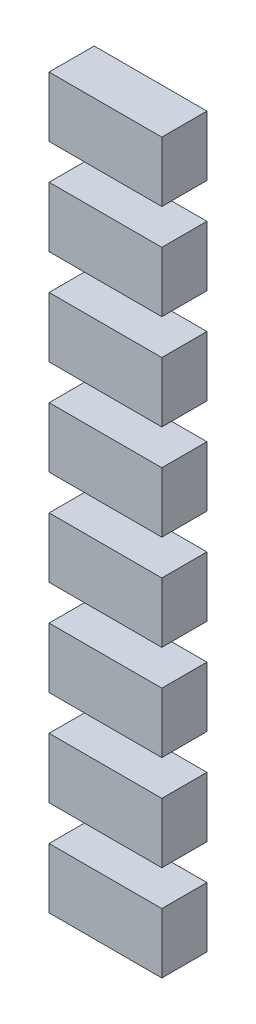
ISO-10303-21;
HEADER;
FILE_DESCRIPTION(('STEP AP214'),'2;1');
FILE_NAME('part.step','',(''),(''),'','','');
FILE_SCHEMA(('AUTOMOTIVE_DESIGN { 1 0 10303 214 1 1 1 1 }'));
ENDSEC;
DATA;
#1=APPLICATION_CONTEXT('core data for automotive mechanical design processes');
#2=APPLICATION_PROTOCOL_DEFINITION('international standard','automotive_design',2000,#1);
#3=PRODUCT_CONTEXT('',#1,'mechanical');
#4=PRODUCT('Part','Part','',(#3));
#5=PRODUCT_RELATED_PRODUCT_CATEGORY('part','',(#4));
#6=PRODUCT_DEFINITION_FORMATION('','',#4);
#7=PRODUCT_DEFINITION_CONTEXT('part definition',#1,'design');
#8=PRODUCT_DEFINITION('design','',#6,#7);
#9=PRODUCT_DEFINITION_SHAPE('','',#8);
#10=(LENGTH_UNIT() NAMED_UNIT(*) SI_UNIT(.MILLI.,.METRE.));
#11=(NAMED_UNIT(*) PLANE_ANGLE_UNIT() SI_UNIT($,.RADIAN.));
#12=(NAMED_UNIT(*) SI_UNIT($,.STERADIAN.) SOLID_ANGLE_UNIT());
#13=UNCERTAINTY_MEASURE_WITH_UNIT(LENGTH_MEASURE(1.E-05),#10,'distance_accuracy_value','');
#14=(GEOMETRIC_REPRESENTATION_CONTEXT(3) GLOBAL_UNCERTAINTY_ASSIGNED_CONTEXT((#13)) GLOBAL_UNIT_ASSIGNED_CONTEXT((#10,
#11,#12)) REPRESENTATION_CONTEXT('',''));
#15=CARTESIAN_POINT('',(0.,0.,0.));
#16=DIRECTION('',(0.,0.,1.));
#17=DIRECTION('',(1.,0.,0.));
#18=AXIS2_PLACEMENT_3D('',#15,#16,#17);
#19=CARTESIAN_POINT('',(28.,-13.864,0.));
#20=DIRECTION('',(1.,0.,0.));
#21=DIRECTION('',(0.,0.,-1.));
#22=AXIS2_PLACEMENT_3D('',#19,#20,#21);
#23=PLANE('',#22);
#24=DIRECTION('',(0.,-1.,0.));
#25=VECTOR('',#24,1.);
#26=CARTESIAN_POINT('',(28.,-13.864,-1.2));
#27=LINE('',#26,#25);
#28=CARTESIAN_POINT('',(28.,-13.864,-1.2));
#29=VERTEX_POINT('',#28);
#30=CARTESIAN_POINT('',(28.,-15.464,-1.2));
#31=VERTEX_POINT('',#30);
#32=EDGE_CURVE('E12',#29,#31,#27,.T.);
#33=ORIENTED_EDGE('',*,*,#32,.T.);
#34=DIRECTION('',(0.,0.,-1.));
#35=VECTOR('',#34,1.);
#36=CARTESIAN_POINT('',(28.,-15.464,0.));
#37=LINE('',#36,#35);
#38=CARTESIAN_POINT('',(28.,-15.464,0.));
#39=VERTEX_POINT('',#38);
#40=EDGE_CURVE('E127',#39,#31,#37,.T.);
#41=ORIENTED_EDGE('',*,*,#40,.F.);
#42=DIRECTION('',(0.,-1.,0.));
#43=VECTOR('',#42,1.);
#44=CARTESIAN_POINT('',(28.,-13.864,0.));
#45=LINE('',#44,#43);
#46=CARTESIAN_POINT('',(28.,-13.864,0.));
#47=VERTEX_POINT('',#46);
#48=EDGE_CURVE('E60',#47,#39,#45,.T.);
#49=ORIENTED_EDGE('',*,*,#48,.F.);
#50=DIRECTION('',(0.,0.,-1.));
#51=VECTOR('',#50,1.);
#52=CARTESIAN_POINT('',(28.,-13.864,0.));
#53=LINE('',#52,#51);
#54=EDGE_CURVE('E115',#47,#29,#53,.T.);
#55=ORIENTED_EDGE('',*,*,#54,.T.);
#56=EDGE_LOOP('',(#33,#41,#49,#55));
#57=FACE_BOUND('',#56,.T.);
#58=ADVANCED_FACE('F56',(#57),#23,.F.);
#59=CARTESIAN_POINT('',(28.,-15.464,0.));
#60=DIRECTION('',(0.,1.,0.));
#61=DIRECTION('',(0.,0.,1.));
#62=AXIS2_PLACEMENT_3D('',#59,#60,#61);
#63=PLANE('',#62);
#64=DIRECTION('',(1.,0.,0.));
#65=VECTOR('',#64,1.);
#66=CARTESIAN_POINT('',(28.,-15.464,-1.2));
#67=LINE('',#66,#65);
#68=CARTESIAN_POINT('',(31.,-15.464,-1.2));
#69=VERTEX_POINT('',#68);
#70=EDGE_CURVE('E66',#31,#69,#67,.T.);
#71=ORIENTED_EDGE('',*,*,#70,.T.);
#72=DIRECTION('',(0.,0.,-1.));
#73=VECTOR('',#72,1.);
#74=CARTESIAN_POINT('',(31.,-15.464,0.));
#75=LINE('',#74,#73);
#76=CARTESIAN_POINT('',(31.,-15.464,0.));
#77=VERTEX_POINT('',#76);
#78=EDGE_CURVE('E111',#77,#69,#75,.T.);
#79=ORIENTED_EDGE('',*,*,#78,.F.);
#80=DIRECTION('',(1.,0.,0.));
#81=VECTOR('',#80,1.);
#82=CARTESIAN_POINT('',(28.,-15.464,0.));
#83=LINE('',#82,#81);
#84=EDGE_CURVE('E90',#39,#77,#83,.T.);
#85=ORIENTED_EDGE('',*,*,#84,.F.);
#86=ORIENTED_EDGE('',*,*,#40,.T.);
#87=EDGE_LOOP('',(#71,#79,#85,#86));
#88=FACE_BOUND('',#87,.T.);
#89=ADVANCED_FACE('F130',(#88),#63,.F.);
#90=CARTESIAN_POINT('',(31.,-15.464,0.));
#91=DIRECTION('',(-1.,0.,0.));
#92=DIRECTION('',(0.,0.,1.));
#93=AXIS2_PLACEMENT_3D('',#90,#91,#92);
#94=PLANE('',#93);
#95=DIRECTION('',(0.,1.,0.));
#96=VECTOR('',#95,1.);
#97=CARTESIAN_POINT('',(31.,-15.464,-1.2));
#98=LINE('',#97,#96);
#99=CARTESIAN_POINT('',(31.,-13.864,-1.2));
#100=VERTEX_POINT('',#99);
#101=EDGE_CURVE('E106',#69,#100,#98,.T.);
#102=ORIENTED_EDGE('',*,*,#101,.T.);
#103=DIRECTION('',(0.,0.,-1.));
#104=VECTOR('',#103,1.);
#105=CARTESIAN_POINT('',(31.,-13.864,0.));
#106=LINE('',#105,#104);
#107=CARTESIAN_POINT('',(31.,-13.864,0.));
#108=VERTEX_POINT('',#107);
#109=EDGE_CURVE('E109',#108,#100,#106,.T.);
#110=ORIENTED_EDGE('',*,*,#109,.F.);
#111=DIRECTION('',(0.,1.,0.));
#112=VECTOR('',#111,1.);
#113=CARTESIAN_POINT('',(31.,-15.464,0.));
#114=LINE('',#113,#112);
#115=EDGE_CURVE('E123',#77,#108,#114,.T.);
#116=ORIENTED_EDGE('',*,*,#115,.F.);
#117=ORIENTED_EDGE('',*,*,#78,.T.);
#118=EDGE_LOOP('',(#102,#110,#116,#117));
#119=FACE_BOUND('',#118,.T.);
#120=ADVANCED_FACE('F107',(#119),#94,.F.);
#121=CARTESIAN_POINT('',(31.,-13.864,0.));
#122=DIRECTION('',(0.,-1.,0.));
#123=DIRECTION('',(0.,0.,-1.));
#124=AXIS2_PLACEMENT_3D('',#121,#122,#123);
#125=PLANE('',#124);
#126=DIRECTION('',(-1.,0.,0.));
#127=VECTOR('',#126,1.);
#128=CARTESIAN_POINT('',(31.,-13.864,-1.2));
#129=LINE('',#128,#127);
#130=EDGE_CURVE('E100',#100,#29,#129,.T.);
#131=ORIENTED_EDGE('',*,*,#130,.T.);
#132=ORIENTED_EDGE('',*,*,#54,.F.);
#133=DIRECTION('',(-1.,0.,0.));
#134=VECTOR('',#133,1.);
#135=CARTESIAN_POINT('',(31.,-13.864,0.));
#136=LINE('',#135,#134);
#137=EDGE_CURVE('E114',#108,#47,#136,.T.);
#138=ORIENTED_EDGE('',*,*,#137,.F.);
#139=ORIENTED_EDGE('',*,*,#109,.T.);
#140=EDGE_LOOP('',(#131,#132,#138,#139));
#141=FACE_BOUND('',#140,.T.);
#142=ADVANCED_FACE('F113',(#141),#125,.F.);
#143=CARTESIAN_POINT('',(0.,0.,0.));
#144=DIRECTION('',(0.,0.,1.));
#145=DIRECTION('',(1.,0.,0.));
#146=AXIS2_PLACEMENT_3D('',#143,#144,#145);
#147=PLANE('',#146);
#148=ORIENTED_EDGE('',*,*,#48,.T.);
#149=ORIENTED_EDGE('',*,*,#84,.T.);
#150=ORIENTED_EDGE('',*,*,#115,.T.);
#151=ORIENTED_EDGE('',*,*,#137,.T.);
#152=EDGE_LOOP('',(#148,#149,#150,#151));
#153=FACE_BOUND('',#152,.T.);
#154=ADVANCED_FACE('F58',(#153),#147,.T.);
#155=CARTESIAN_POINT('',(0.,0.,-1.2));
#156=DIRECTION('',(0.,0.,1.));
#157=DIRECTION('',(1.,0.,0.));
#158=AXIS2_PLACEMENT_3D('',#155,#156,#157);
#159=PLANE('',#158);
#160=ORIENTED_EDGE('',*,*,#32,.F.);
#161=ORIENTED_EDGE('',*,*,#130,.F.);
#162=ORIENTED_EDGE('',*,*,#101,.F.);
#163=ORIENTED_EDGE('',*,*,#70,.F.);
#164=EDGE_LOOP('',(#160,#161,#162,#163));
#165=FACE_BOUND('',#164,.T.);
#166=ADVANCED_FACE('F117',(#165),#159,.F.);
#167=CLOSED_SHELL('',(#58,#89,#120,#142,#154,#166));
#168=MANIFOLD_SOLID_BREP('B2',#167);
#169=CARTESIAN_POINT('',(28.,-21.484,0.));
#170=DIRECTION('',(1.,0.,0.));
#171=DIRECTION('',(0.,0.,-1.));
#172=AXIS2_PLACEMENT_3D('',#169,#170,#171);
#173=PLANE('',#172);
#174=DIRECTION('',(0.,-1.,0.));
#175=VECTOR('',#174,1.);
#176=CARTESIAN_POINT('',(28.,-21.484,-1.2));
#177=LINE('',#176,#175);
#178=CARTESIAN_POINT('',(28.,-21.484,-1.2));
#179=VERTEX_POINT('',#178);
#180=CARTESIAN_POINT('',(28.,-23.084,-1.2));
#181=VERTEX_POINT('',#180);
#182=EDGE_CURVE('E54',#179,#181,#177,.T.);
#183=ORIENTED_EDGE('',*,*,#182,.T.);
#184=DIRECTION('',(0.,0.,-1.));
#185=VECTOR('',#184,1.);
#186=CARTESIAN_POINT('',(28.,-23.084,0.));
#187=LINE('',#186,#185);
#188=CARTESIAN_POINT('',(28.,-23.084,0.));
#189=VERTEX_POINT('',#188);
#190=EDGE_CURVE('E261',#189,#181,#187,.T.);
#191=ORIENTED_EDGE('',*,*,#190,.F.);
#192=DIRECTION('',(0.,-1.,0.));
#193=VECTOR('',#192,1.);
#194=CARTESIAN_POINT('',(28.,-21.484,0.));
#195=LINE('',#194,#193);
#196=CARTESIAN_POINT('',(28.,-21.484,0.));
#197=VERTEX_POINT('',#196);
#198=EDGE_CURVE('E194',#197,#189,#195,.T.);
#199=ORIENTED_EDGE('',*,*,#198,.F.);
#200=DIRECTION('',(0.,0.,-1.));
#201=VECTOR('',#200,1.);
#202=CARTESIAN_POINT('',(28.,-21.484,0.));
#203=LINE('',#202,#201);
#204=EDGE_CURVE('E249',#197,#179,#203,.T.);
#205=ORIENTED_EDGE('',*,*,#204,.T.);
#206=EDGE_LOOP('',(#183,#191,#199,#205));
#207=FACE_BOUND('',#206,.T.);
#208=ADVANCED_FACE('F190',(#207),#173,.F.);
#209=CARTESIAN_POINT('',(28.,-23.084,0.));
#210=DIRECTION('',(0.,1.,0.));
#211=DIRECTION('',(0.,0.,1.));
#212=AXIS2_PLACEMENT_3D('',#209,#210,#211);
#213=PLANE('',#212);
#214=DIRECTION('',(1.,0.,0.));
#215=VECTOR('',#214,1.);
#216=CARTESIAN_POINT('',(28.,-23.084,-1.2));
#217=LINE('',#216,#215);
#218=CARTESIAN_POINT('',(31.,-23.084,-1.2));
#219=VERTEX_POINT('',#218);
#220=EDGE_CURVE('E200',#181,#219,#217,.T.);
#221=ORIENTED_EDGE('',*,*,#220,.T.);
#222=DIRECTION('',(0.,0.,-1.));
#223=VECTOR('',#222,1.);
#224=CARTESIAN_POINT('',(31.,-23.084,0.));
#225=LINE('',#224,#223);
#226=CARTESIAN_POINT('',(31.,-23.084,0.));
#227=VERTEX_POINT('',#226);
#228=EDGE_CURVE('E245',#227,#219,#225,.T.);
#229=ORIENTED_EDGE('',*,*,#228,.F.);
#230=DIRECTION('',(1.,0.,0.));
#231=VECTOR('',#230,1.);
#232=CARTESIAN_POINT('',(28.,-23.084,0.));
#233=LINE('',#232,#231);
#234=EDGE_CURVE('E224',#189,#227,#233,.T.);
#235=ORIENTED_EDGE('',*,*,#234,.F.);
#236=ORIENTED_EDGE('',*,*,#190,.T.);
#237=EDGE_LOOP('',(#221,#229,#235,#236));
#238=FACE_BOUND('',#237,.T.);
#239=ADVANCED_FACE('F264',(#238),#213,.F.);
#240=CARTESIAN_POINT('',(31.,-23.084,0.));
#241=DIRECTION('',(-1.,0.,0.));
#242=DIRECTION('',(0.,0.,1.));
#243=AXIS2_PLACEMENT_3D('',#240,#241,#242);
#244=PLANE('',#243);
#245=DIRECTION('',(0.,1.,0.));
#246=VECTOR('',#245,1.);
#247=CARTESIAN_POINT('',(31.,-23.084,-1.2));
#248=LINE('',#247,#246);
#249=CARTESIAN_POINT('',(31.,-21.484,-1.2));
#250=VERTEX_POINT('',#249);
#251=EDGE_CURVE('E240',#219,#250,#248,.T.);
#252=ORIENTED_EDGE('',*,*,#251,.T.);
#253=DIRECTION('',(0.,0.,-1.));
#254=VECTOR('',#253,1.);
#255=CARTESIAN_POINT('',(31.,-21.484,0.));
#256=LINE('',#255,#254);
#257=CARTESIAN_POINT('',(31.,-21.484,0.));
#258=VERTEX_POINT('',#257);
#259=EDGE_CURVE('E243',#258,#250,#256,.T.);
#260=ORIENTED_EDGE('',*,*,#259,.F.);
#261=DIRECTION('',(0.,1.,0.));
#262=VECTOR('',#261,1.);
#263=CARTESIAN_POINT('',(31.,-23.084,0.));
#264=LINE('',#263,#262);
#265=EDGE_CURVE('E257',#227,#258,#264,.T.);
#266=ORIENTED_EDGE('',*,*,#265,.F.);
#267=ORIENTED_EDGE('',*,*,#228,.T.);
#268=EDGE_LOOP('',(#252,#260,#266,#267));
#269=FACE_BOUND('',#268,.T.);
#270=ADVANCED_FACE('F241',(#269),#244,.F.);
#271=CARTESIAN_POINT('',(31.,-21.484,0.));
#272=DIRECTION('',(0.,-1.,0.));
#273=DIRECTION('',(0.,0.,-1.));
#274=AXIS2_PLACEMENT_3D('',#271,#272,#273);
#275=PLANE('',#274);
#276=DIRECTION('',(-1.,0.,0.));
#277=VECTOR('',#276,1.);
#278=CARTESIAN_POINT('',(31.,-21.484,-1.2));
#279=LINE('',#278,#277);
#280=EDGE_CURVE('E234',#250,#179,#279,.T.);
#281=ORIENTED_EDGE('',*,*,#280,.T.);
#282=ORIENTED_EDGE('',*,*,#204,.F.);
#283=DIRECTION('',(-1.,0.,0.));
#284=VECTOR('',#283,1.);
#285=CARTESIAN_POINT('',(31.,-21.484,0.));
#286=LINE('',#285,#284);
#287=EDGE_CURVE('E248',#258,#197,#286,.T.);
#288=ORIENTED_EDGE('',*,*,#287,.F.);
#289=ORIENTED_EDGE('',*,*,#259,.T.);
#290=EDGE_LOOP('',(#281,#282,#288,#289));
#291=FACE_BOUND('',#290,.T.);
#292=ADVANCED_FACE('F247',(#291),#275,.F.);
#293=CARTESIAN_POINT('',(0.,0.,0.));
#294=DIRECTION('',(0.,0.,1.));
#295=DIRECTION('',(1.,0.,0.));
#296=AXIS2_PLACEMENT_3D('',#293,#294,#295);
#297=PLANE('',#296);
#298=ORIENTED_EDGE('',*,*,#198,.T.);
#299=ORIENTED_EDGE('',*,*,#234,.T.);
#300=ORIENTED_EDGE('',*,*,#265,.T.);
#301=ORIENTED_EDGE('',*,*,#287,.T.);
#302=EDGE_LOOP('',(#298,#299,#300,#301));
#303=FACE_BOUND('',#302,.T.);
#304=ADVANCED_FACE('F192',(#303),#297,.T.);
#305=CARTESIAN_POINT('',(0.,0.,-1.2));
#306=DIRECTION('',(0.,0.,1.));
#307=DIRECTION('',(1.,0.,0.));
#308=AXIS2_PLACEMENT_3D('',#305,#306,#307);
#309=PLANE('',#308);
#310=ORIENTED_EDGE('',*,*,#182,.F.);
#311=ORIENTED_EDGE('',*,*,#280,.F.);
#312=ORIENTED_EDGE('',*,*,#251,.F.);
#313=ORIENTED_EDGE('',*,*,#220,.F.);
#314=EDGE_LOOP('',(#310,#311,#312,#313));
#315=FACE_BOUND('',#314,.T.);
#316=ADVANCED_FACE('F251',(#315),#309,.F.);
#317=CLOSED_SHELL('',(#208,#239,#270,#292,#304,#316));
#318=MANIFOLD_SOLID_BREP('B6',#317);
#319=CARTESIAN_POINT('',(28.,-16.404,0.));
#320=DIRECTION('',(1.,0.,0.));
#321=DIRECTION('',(0.,0.,-1.));
#322=AXIS2_PLACEMENT_3D('',#319,#320,#321);
#323=PLANE('',#322);
#324=DIRECTION('',(0.,-1.,0.));
#325=VECTOR('',#324,1.);
#326=CARTESIAN_POINT('',(28.,-16.404,-1.2));
#327=LINE('',#326,#325);
#328=CARTESIAN_POINT('',(28.,-16.404,-1.2));
#329=VERTEX_POINT('',#328);
#330=CARTESIAN_POINT('',(28.,-18.004,-1.2));
#331=VERTEX_POINT('',#330);
#332=EDGE_CURVE('E188',#329,#331,#327,.T.);
#333=ORIENTED_EDGE('',*,*,#332,.T.);
#334=DIRECTION('',(0.,0.,-1.));
#335=VECTOR('',#334,1.);
#336=CARTESIAN_POINT('',(28.,-18.004,0.));
#337=LINE('',#336,#335);
#338=CARTESIAN_POINT('',(28.,-18.004,0.));
#339=VERTEX_POINT('',#338);
#340=EDGE_CURVE('E404',#339,#331,#337,.T.);
#341=ORIENTED_EDGE('',*,*,#340,.F.);
#342=DIRECTION('',(0.,-1.,0.));
#343=VECTOR('',#342,1.);
#344=CARTESIAN_POINT('',(28.,-16.404,0.));
#345=LINE('',#344,#343);
#346=CARTESIAN_POINT('',(28.,-16.404,0.));
#347=VERTEX_POINT('',#346);
#348=EDGE_CURVE('E328',#347,#339,#345,.T.);
#349=ORIENTED_EDGE('',*,*,#348,.F.);
#350=DIRECTION('',(0.,0.,-1.));
#351=VECTOR('',#350,1.);
#352=CARTESIAN_POINT('',(28.,-16.404,0.));
#353=LINE('',#352,#351);
#354=EDGE_CURVE('E386',#347,#329,#353,.T.);
#355=ORIENTED_EDGE('',*,*,#354,.T.);
#356=EDGE_LOOP('',(#333,#341,#349,#355));
#357=FACE_BOUND('',#356,.T.);
#358=ADVANCED_FACE('F324',(#357),#323,.F.);
#359=CARTESIAN_POINT('',(28.,-18.004,0.));
#360=DIRECTION('',(0.,1.,0.));
#361=DIRECTION('',(0.,0.,1.));
#362=AXIS2_PLACEMENT_3D('',#359,#360,#361);
#363=PLANE('',#362);
#364=DIRECTION('',(1.,0.,0.));
#365=VECTOR('',#364,1.);
#366=CARTESIAN_POINT('',(28.,-18.004,-1.2));
#367=LINE('',#366,#365);
#368=CARTESIAN_POINT('',(31.,-18.004,-1.2));
#369=VERTEX_POINT('',#368);
#370=EDGE_CURVE('E335',#331,#369,#367,.T.);
#371=ORIENTED_EDGE('',*,*,#370,.T.);
#372=DIRECTION('',(0.,0.,-1.));
#373=VECTOR('',#372,1.);
#374=CARTESIAN_POINT('',(31.,-18.004,0.));
#375=LINE('',#374,#373);
#376=CARTESIAN_POINT('',(31.,-18.004,0.));
#377=VERTEX_POINT('',#376);
#378=EDGE_CURVE('E380',#377,#369,#375,.T.);
#379=ORIENTED_EDGE('',*,*,#378,.F.);
#380=DIRECTION('',(1.,0.,0.));
#381=VECTOR('',#380,1.);
#382=CARTESIAN_POINT('',(28.,-18.004,0.));
#383=LINE('',#382,#381);
#384=EDGE_CURVE('E359',#339,#377,#383,.T.);
#385=ORIENTED_EDGE('',*,*,#384,.F.);
#386=ORIENTED_EDGE('',*,*,#340,.T.);
#387=EDGE_LOOP('',(#371,#379,#385,#386));
#388=FACE_BOUND('',#387,.T.);
#389=ADVANCED_FACE('F408',(#388),#363,.F.);
#390=CARTESIAN_POINT('',(31.,-18.004,0.));
#391=DIRECTION('',(-1.,0.,0.));
#392=DIRECTION('',(0.,0.,1.));
#393=AXIS2_PLACEMENT_3D('',#390,#391,#392);
#394=PLANE('',#393);
#395=DIRECTION('',(0.,1.,0.));
#396=VECTOR('',#395,1.);
#397=CARTESIAN_POINT('',(31.,-18.004,-1.2));
#398=LINE('',#397,#396);
#399=CARTESIAN_POINT('',(31.,-16.404,-1.2));
#400=VERTEX_POINT('',#399);
#401=EDGE_CURVE('E375',#369,#400,#398,.T.);
#402=ORIENTED_EDGE('',*,*,#401,.T.);
#403=DIRECTION('',(0.,0.,-1.));
#404=VECTOR('',#403,1.);
#405=CARTESIAN_POINT('',(31.,-16.404,0.));
#406=LINE('',#405,#404);
#407=CARTESIAN_POINT('',(31.,-16.404,0.));
#408=VERTEX_POINT('',#407);
#409=EDGE_CURVE('E378',#408,#400,#406,.T.);
#410=ORIENTED_EDGE('',*,*,#409,.F.);
#411=DIRECTION('',(0.,1.,0.));
#412=VECTOR('',#411,1.);
#413=CARTESIAN_POINT('',(31.,-18.004,0.));
#414=LINE('',#413,#412);
#415=EDGE_CURVE('E398',#377,#408,#414,.T.);
#416=ORIENTED_EDGE('',*,*,#415,.F.);
#417=ORIENTED_EDGE('',*,*,#378,.T.);
#418=EDGE_LOOP('',(#402,#410,#416,#417));
#419=FACE_BOUND('',#418,.T.);
#420=ADVANCED_FACE('F376',(#419),#394,.F.);
#421=CARTESIAN_POINT('',(31.,-16.404,0.));
#422=DIRECTION('',(0.,-1.,0.));
#423=DIRECTION('',(0.,0.,-1.));
#424=AXIS2_PLACEMENT_3D('',#421,#422,#423);
#425=PLANE('',#424);
#426=DIRECTION('',(-1.,0.,0.));
#427=VECTOR('',#426,1.);
#428=CARTESIAN_POINT('',(31.,-16.404,-1.2));
#429=LINE('',#428,#427);
#430=EDGE_CURVE('E369',#400,#329,#429,.T.);
#431=ORIENTED_EDGE('',*,*,#430,.T.);
#432=ORIENTED_EDGE('',*,*,#354,.F.);
#433=DIRECTION('',(-1.,0.,0.));
#434=VECTOR('',#433,1.);
#435=CARTESIAN_POINT('',(31.,-16.404,0.));
#436=LINE('',#435,#434);
#437=EDGE_CURVE('E384',#408,#347,#436,.T.);
#438=ORIENTED_EDGE('',*,*,#437,.F.);
#439=ORIENTED_EDGE('',*,*,#409,.T.);
#440=EDGE_LOOP('',(#431,#432,#438,#439));
#441=FACE_BOUND('',#440,.T.);
#442=ADVANCED_FACE('F383',(#441),#425,.F.);
#443=CARTESIAN_POINT('',(0.,0.,0.));
#444=DIRECTION('',(0.,0.,1.));
#445=DIRECTION('',(1.,0.,0.));
#446=AXIS2_PLACEMENT_3D('',#443,#444,#445);
#447=PLANE('',#446);
#448=ORIENTED_EDGE('',*,*,#348,.T.);
#449=ORIENTED_EDGE('',*,*,#384,.T.);
#450=ORIENTED_EDGE('',*,*,#415,.T.);
#451=ORIENTED_EDGE('',*,*,#437,.T.);
#452=EDGE_LOOP('',(#448,#449,#450,#451));
#453=FACE_BOUND('',#452,.T.);
#454=ADVANCED_FACE('F326',(#453),#447,.T.);
#455=CARTESIAN_POINT('',(0.,0.,-1.2));
#456=DIRECTION('',(0.,0.,1.));
#457=DIRECTION('',(1.,0.,0.));
#458=AXIS2_PLACEMENT_3D('',#455,#456,#457);
#459=PLANE('',#458);
#460=ORIENTED_EDGE('',*,*,#332,.F.);
#461=ORIENTED_EDGE('',*,*,#430,.F.);
#462=ORIENTED_EDGE('',*,*,#401,.F.);
#463=ORIENTED_EDGE('',*,*,#370,.F.);
#464=EDGE_LOOP('',(#460,#461,#462,#463));
#465=FACE_BOUND('',#464,.T.);
#466=ADVANCED_FACE('F388',(#465),#459,.F.);
#467=CLOSED_SHELL('',(#358,#389,#420,#442,#454,#466));
#468=MANIFOLD_SOLID_BREP('B48',#467);
#469=CARTESIAN_POINT('',(28.,-18.944,0.));
#470=DIRECTION('',(1.,0.,0.));
#471=DIRECTION('',(0.,0.,-1.));
#472=AXIS2_PLACEMENT_3D('',#469,#470,#471);
#473=PLANE('',#472);
#474=DIRECTION('',(0.,-1.,0.));
#475=VECTOR('',#474,1.);
#476=CARTESIAN_POINT('',(28.,-18.944,-1.2));
#477=LINE('',#476,#475);
#478=CARTESIAN_POINT('',(28.,-18.944,-1.2));
#479=VERTEX_POINT('',#478);
#480=CARTESIAN_POINT('',(28.,-20.544,-1.2));
#481=VERTEX_POINT('',#480);
#482=EDGE_CURVE('E322',#479,#481,#477,.T.);
#483=ORIENTED_EDGE('',*,*,#482,.T.);
#484=DIRECTION('',(0.,0.,-1.));
#485=VECTOR('',#484,1.);
#486=CARTESIAN_POINT('',(28.,-20.544,0.));
#487=LINE('',#486,#485);
#488=CARTESIAN_POINT('',(28.,-20.544,0.));
#489=VERTEX_POINT('',#488);
#490=EDGE_CURVE('E541',#489,#481,#487,.T.);
#491=ORIENTED_EDGE('',*,*,#490,.F.);
#492=DIRECTION('',(0.,-1.,0.));
#493=VECTOR('',#492,1.);
#494=CARTESIAN_POINT('',(28.,-18.944,0.));
#495=LINE('',#494,#493);
#496=CARTESIAN_POINT('',(28.,-18.944,0.));
#497=VERTEX_POINT('',#496);
#498=EDGE_CURVE('E474',#497,#489,#495,.T.);
#499=ORIENTED_EDGE('',*,*,#498,.F.);
#500=DIRECTION('',(0.,0.,-1.));
#501=VECTOR('',#500,1.);
#502=CARTESIAN_POINT('',(28.,-18.944,0.));
#503=LINE('',#502,#501);
#504=EDGE_CURVE('E529',#497,#479,#503,.T.);
#505=ORIENTED_EDGE('',*,*,#504,.T.);
#506=EDGE_LOOP('',(#483,#491,#499,#505));
#507=FACE_BOUND('',#506,.T.);
#508=ADVANCED_FACE('F470',(#507),#473,.F.);
#509=CARTESIAN_POINT('',(28.,-20.544,0.));
#510=DIRECTION('',(0.,1.,0.));
#511=DIRECTION('',(0.,0.,1.));
#512=AXIS2_PLACEMENT_3D('',#509,#510,#511);
#513=PLANE('',#512);
#514=DIRECTION('',(1.,0.,0.));
#515=VECTOR('',#514,1.);
#516=CARTESIAN_POINT('',(28.,-20.544,-1.2));
#517=LINE('',#516,#515);
#518=CARTESIAN_POINT('',(31.,-20.544,-1.2));
#519=VERTEX_POINT('',#518);
#520=EDGE_CURVE('E480',#481,#519,#517,.T.);
#521=ORIENTED_EDGE('',*,*,#520,.T.);
#522=DIRECTION('',(0.,0.,-1.));
#523=VECTOR('',#522,1.);
#524=CARTESIAN_POINT('',(31.,-20.544,0.));
#525=LINE('',#524,#523);
#526=CARTESIAN_POINT('',(31.,-20.544,0.));
#527=VERTEX_POINT('',#526);
#528=EDGE_CURVE('E525',#527,#519,#525,.T.);
#529=ORIENTED_EDGE('',*,*,#528,.F.);
#530=DIRECTION('',(1.,0.,0.));
#531=VECTOR('',#530,1.);
#532=CARTESIAN_POINT('',(28.,-20.544,0.));
#533=LINE('',#532,#531);
#534=EDGE_CURVE('E504',#489,#527,#533,.T.);
#535=ORIENTED_EDGE('',*,*,#534,.F.);
#536=ORIENTED_EDGE('',*,*,#490,.T.);
#537=EDGE_LOOP('',(#521,#529,#535,#536));
#538=FACE_BOUND('',#537,.T.);
#539=ADVANCED_FACE('F544',(#538),#513,.F.);
#540=CARTESIAN_POINT('',(31.,-20.544,0.));
#541=DIRECTION('',(-1.,0.,0.));
#542=DIRECTION('',(0.,0.,1.));
#543=AXIS2_PLACEMENT_3D('',#540,#541,#542);
#544=PLANE('',#543);
#545=DIRECTION('',(0.,1.,0.));
#546=VECTOR('',#545,1.);
#547=CARTESIAN_POINT('',(31.,-20.544,-1.2));
#548=LINE('',#547,#546);
#549=CARTESIAN_POINT('',(31.,-18.944,-1.2));
#550=VERTEX_POINT('',#549);
#551=EDGE_CURVE('E520',#519,#550,#548,.T.);
#552=ORIENTED_EDGE('',*,*,#551,.T.);
#553=DIRECTION('',(0.,0.,-1.));
#554=VECTOR('',#553,1.);
#555=CARTESIAN_POINT('',(31.,-18.944,0.));
#556=LINE('',#555,#554);
#557=CARTESIAN_POINT('',(31.,-18.944,0.));
#558=VERTEX_POINT('',#557);
#559=EDGE_CURVE('E523',#558,#550,#556,.T.);
#560=ORIENTED_EDGE('',*,*,#559,.F.);
#561=DIRECTION('',(0.,1.,0.));
#562=VECTOR('',#561,1.);
#563=CARTESIAN_POINT('',(31.,-20.544,0.));
#564=LINE('',#563,#562);
#565=EDGE_CURVE('E537',#527,#558,#564,.T.);
#566=ORIENTED_EDGE('',*,*,#565,.F.);
#567=ORIENTED_EDGE('',*,*,#528,.T.);
#568=EDGE_LOOP('',(#552,#560,#566,#567));
#569=FACE_BOUND('',#568,.T.);
#570=ADVANCED_FACE('F521',(#569),#544,.F.);
#571=CARTESIAN_POINT('',(31.,-18.944,0.));
#572=DIRECTION('',(0.,-1.,0.));
#573=DIRECTION('',(0.,0.,-1.));
#574=AXIS2_PLACEMENT_3D('',#571,#572,#573);
#575=PLANE('',#574);
#576=DIRECTION('',(-1.,0.,0.));
#577=VECTOR('',#576,1.);
#578=CARTESIAN_POINT('',(31.,-18.944,-1.2));
#579=LINE('',#578,#577);
#580=EDGE_CURVE('E514',#550,#479,#579,.T.);
#581=ORIENTED_EDGE('',*,*,#580,.T.);
#582=ORIENTED_EDGE('',*,*,#504,.F.);
#583=DIRECTION('',(-1.,0.,0.));
#584=VECTOR('',#583,1.);
#585=CARTESIAN_POINT('',(31.,-18.944,0.));
#586=LINE('',#585,#584);
#587=EDGE_CURVE('E528',#558,#497,#586,.T.);
#588=ORIENTED_EDGE('',*,*,#587,.F.);
#589=ORIENTED_EDGE('',*,*,#559,.T.);
#590=EDGE_LOOP('',(#581,#582,#588,#589));
#591=FACE_BOUND('',#590,.T.);
#592=ADVANCED_FACE('F527',(#591),#575,.F.);
#593=CARTESIAN_POINT('',(0.,0.,0.));
#594=DIRECTION('',(0.,0.,1.));
#595=DIRECTION('',(1.,0.,0.));
#596=AXIS2_PLACEMENT_3D('',#593,#594,#595);
#597=PLANE('',#596);
#598=ORIENTED_EDGE('',*,*,#498,.T.);
#599=ORIENTED_EDGE('',*,*,#534,.T.);
#600=ORIENTED_EDGE('',*,*,#565,.T.);
#601=ORIENTED_EDGE('',*,*,#587,.T.);
#602=EDGE_LOOP('',(#598,#599,#600,#601));
#603=FACE_BOUND('',#602,.T.);
#604=ADVANCED_FACE('F472',(#603),#597,.T.);
#605=CARTESIAN_POINT('',(0.,0.,-1.2));
#606=DIRECTION('',(0.,0.,1.));
#607=DIRECTION('',(1.,0.,0.));
#608=AXIS2_PLACEMENT_3D('',#605,#606,#607);
#609=PLANE('',#608);
#610=ORIENTED_EDGE('',*,*,#482,.F.);
#611=ORIENTED_EDGE('',*,*,#580,.F.);
#612=ORIENTED_EDGE('',*,*,#551,.F.);
#613=ORIENTED_EDGE('',*,*,#520,.F.);
#614=EDGE_LOOP('',(#610,#611,#612,#613));
#615=FACE_BOUND('',#614,.T.);
#616=ADVANCED_FACE('F531',(#615),#609,.F.);
#617=CLOSED_SHELL('',(#508,#539,#570,#592,#604,#616));
#618=MANIFOLD_SOLID_BREP('B182',#617);
#619=CARTESIAN_POINT('',(28.,-24.024,0.));
#620=DIRECTION('',(1.,0.,0.));
#621=DIRECTION('',(0.,0.,-1.));
#622=AXIS2_PLACEMENT_3D('',#619,#620,#621);
#623=PLANE('',#622);
#624=DIRECTION('',(0.,-1.,0.));
#625=VECTOR('',#624,1.);
#626=CARTESIAN_POINT('',(28.,-24.024,-1.2));
#627=LINE('',#626,#625);
#628=CARTESIAN_POINT('',(28.,-24.024,-1.2));
#629=VERTEX_POINT('',#628);
#630=CARTESIAN_POINT('',(28.,-25.624,-1.2));
#631=VERTEX_POINT('',#630);
#632=EDGE_CURVE('E468',#629,#631,#627,.T.);
#633=ORIENTED_EDGE('',*,*,#632,.T.);
#634=DIRECTION('',(0.,0.,-1.));
#635=VECTOR('',#634,1.);
#636=CARTESIAN_POINT('',(28.,-25.624,0.));
#637=LINE('',#636,#635);
#638=CARTESIAN_POINT('',(28.,-25.624,0.));
#639=VERTEX_POINT('',#638);
#640=EDGE_CURVE('E675',#639,#631,#637,.T.);
#641=ORIENTED_EDGE('',*,*,#640,.F.);
#642=DIRECTION('',(0.,-1.,0.));
#643=VECTOR('',#642,1.);
#644=CARTESIAN_POINT('',(28.,-24.024,0.));
#645=LINE('',#644,#643);
#646=CARTESIAN_POINT('',(28.,-24.024,0.));
#647=VERTEX_POINT('',#646);
#648=EDGE_CURVE('E608',#647,#639,#645,.T.);
#649=ORIENTED_EDGE('',*,*,#648,.F.);
#650=DIRECTION('',(0.,0.,-1.));
#651=VECTOR('',#650,1.);
#652=CARTESIAN_POINT('',(28.,-24.024,0.));
#653=LINE('',#652,#651);
#654=EDGE_CURVE('E663',#647,#629,#653,.T.);
#655=ORIENTED_EDGE('',*,*,#654,.T.);
#656=EDGE_LOOP('',(#633,#641,#649,#655));
#657=FACE_BOUND('',#656,.T.);
#658=ADVANCED_FACE('F604',(#657),#623,.F.);
#659=CARTESIAN_POINT('',(28.,-25.624,0.));
#660=DIRECTION('',(0.,1.,0.));
#661=DIRECTION('',(0.,0.,1.));
#662=AXIS2_PLACEMENT_3D('',#659,#660,#661);
#663=PLANE('',#662);
#664=DIRECTION('',(1.,0.,0.));
#665=VECTOR('',#664,1.);
#666=CARTESIAN_POINT('',(28.,-25.624,-1.2));
#667=LINE('',#666,#665);
#668=CARTESIAN_POINT('',(31.,-25.624,-1.2));
#669=VERTEX_POINT('',#668);
#670=EDGE_CURVE('E614',#631,#669,#667,.T.);
#671=ORIENTED_EDGE('',*,*,#670,.T.);
#672=DIRECTION('',(0.,0.,-1.));
#673=VECTOR('',#672,1.);
#674=CARTESIAN_POINT('',(31.,-25.624,0.));
#675=LINE('',#674,#673);
#676=CARTESIAN_POINT('',(31.,-25.624,0.));
#677=VERTEX_POINT('',#676);
#678=EDGE_CURVE('E659',#677,#669,#675,.T.);
#679=ORIENTED_EDGE('',*,*,#678,.F.);
#680=DIRECTION('',(1.,0.,0.));
#681=VECTOR('',#680,1.);
#682=CARTESIAN_POINT('',(28.,-25.624,0.));
#683=LINE('',#682,#681);
#684=EDGE_CURVE('E638',#639,#677,#683,.T.);
#685=ORIENTED_EDGE('',*,*,#684,.F.);
#686=ORIENTED_EDGE('',*,*,#640,.T.);
#687=EDGE_LOOP('',(#671,#679,#685,#686));
#688=FACE_BOUND('',#687,.T.);
#689=ADVANCED_FACE('F678',(#688),#663,.F.);
#690=CARTESIAN_POINT('',(31.,-25.624,0.));
#691=DIRECTION('',(-1.,0.,0.));
#692=DIRECTION('',(0.,0.,1.));
#693=AXIS2_PLACEMENT_3D('',#690,#691,#692);
#694=PLANE('',#693);
#695=DIRECTION('',(0.,1.,0.));
#696=VECTOR('',#695,1.);
#697=CARTESIAN_POINT('',(31.,-25.624,-1.2));
#698=LINE('',#697,#696);
#699=CARTESIAN_POINT('',(31.,-24.024,-1.2));
#700=VERTEX_POINT('',#699);
#701=EDGE_CURVE('E654',#669,#700,#698,.T.);
#702=ORIENTED_EDGE('',*,*,#701,.T.);
#703=DIRECTION('',(0.,0.,-1.));
#704=VECTOR('',#703,1.);
#705=CARTESIAN_POINT('',(31.,-24.024,0.));
#706=LINE('',#705,#704);
#707=CARTESIAN_POINT('',(31.,-24.024,0.));
#708=VERTEX_POINT('',#707);
#709=EDGE_CURVE('E657',#708,#700,#706,.T.);
#710=ORIENTED_EDGE('',*,*,#709,.F.);
#711=DIRECTION('',(0.,1.,0.));
#712=VECTOR('',#711,1.);
#713=CARTESIAN_POINT('',(31.,-25.624,0.));
#714=LINE('',#713,#712);
#715=EDGE_CURVE('E671',#677,#708,#714,.T.);
#716=ORIENTED_EDGE('',*,*,#715,.F.);
#717=ORIENTED_EDGE('',*,*,#678,.T.);
#718=EDGE_LOOP('',(#702,#710,#716,#717));
#719=FACE_BOUND('',#718,.T.);
#720=ADVANCED_FACE('F655',(#719),#694,.F.);
#721=CARTESIAN_POINT('',(31.,-24.024,0.));
#722=DIRECTION('',(0.,-1.,0.));
#723=DIRECTION('',(0.,0.,-1.));
#724=AXIS2_PLACEMENT_3D('',#721,#722,#723);
#725=PLANE('',#724);
#726=DIRECTION('',(-1.,0.,0.));
#727=VECTOR('',#726,1.);
#728=CARTESIAN_POINT('',(31.,-24.024,-1.2));
#729=LINE('',#728,#727);
#730=EDGE_CURVE('E648',#700,#629,#729,.T.);
#731=ORIENTED_EDGE('',*,*,#730,.T.);
#732=ORIENTED_EDGE('',*,*,#654,.F.);
#733=DIRECTION('',(-1.,0.,0.));
#734=VECTOR('',#733,1.);
#735=CARTESIAN_POINT('',(31.,-24.024,0.));
#736=LINE('',#735,#734);
#737=EDGE_CURVE('E662',#708,#647,#736,.T.);
#738=ORIENTED_EDGE('',*,*,#737,.F.);
#739=ORIENTED_EDGE('',*,*,#709,.T.);
#740=EDGE_LOOP('',(#731,#732,#738,#739));
#741=FACE_BOUND('',#740,.T.);
#742=ADVANCED_FACE('F661',(#741),#725,.F.);
#743=CARTESIAN_POINT('',(0.,0.,0.));
#744=DIRECTION('',(0.,0.,1.));
#745=DIRECTION('',(1.,0.,0.));
#746=AXIS2_PLACEMENT_3D('',#743,#744,#745);
#747=PLANE('',#746);
#748=ORIENTED_EDGE('',*,*,#648,.T.);
#749=ORIENTED_EDGE('',*,*,#684,.T.);
#750=ORIENTED_EDGE('',*,*,#715,.T.);
#751=ORIENTED_EDGE('',*,*,#737,.T.);
#752=EDGE_LOOP('',(#748,#749,#750,#751));
#753=FACE_BOUND('',#752,.T.);
#754=ADVANCED_FACE('F606',(#753),#747,.T.);
#755=CARTESIAN_POINT('',(0.,0.,-1.2));
#756=DIRECTION('',(0.,0.,1.));
#757=DIRECTION('',(1.,0.,0.));
#758=AXIS2_PLACEMENT_3D('',#755,#756,#757);
#759=PLANE('',#758);
#760=ORIENTED_EDGE('',*,*,#632,.F.);
#761=ORIENTED_EDGE('',*,*,#730,.F.);
#762=ORIENTED_EDGE('',*,*,#701,.F.);
#763=ORIENTED_EDGE('',*,*,#670,.F.);
#764=EDGE_LOOP('',(#760,#761,#762,#763));
#765=FACE_BOUND('',#764,.T.);
#766=ADVANCED_FACE('F665',(#765),#759,.F.);
#767=CLOSED_SHELL('',(#658,#689,#720,#742,#754,#766));
#768=MANIFOLD_SOLID_BREP('B316',#767);
#769=CARTESIAN_POINT('',(28.,-26.564,0.));
#770=DIRECTION('',(1.,0.,0.));
#771=DIRECTION('',(0.,0.,-1.));
#772=AXIS2_PLACEMENT_3D('',#769,#770,#771);
#773=PLANE('',#772);
#774=DIRECTION('',(0.,-1.,0.));
#775=VECTOR('',#774,1.);
#776=CARTESIAN_POINT('',(28.,-26.564,-1.2));
#777=LINE('',#776,#775);
#778=CARTESIAN_POINT('',(28.,-26.564,-1.2));
#779=VERTEX_POINT('',#778);
#780=CARTESIAN_POINT('',(28.,-28.164,-1.2));
#781=VERTEX_POINT('',#780);
#782=EDGE_CURVE('E602',#779,#781,#777,.T.);
#783=ORIENTED_EDGE('',*,*,#782,.T.);
#784=DIRECTION('',(0.,0.,-1.));
#785=VECTOR('',#784,1.);
#786=CARTESIAN_POINT('',(28.,-28.164,0.));
#787=LINE('',#786,#785);
#788=CARTESIAN_POINT('',(28.,-28.164,0.));
#789=VERTEX_POINT('',#788);
#790=EDGE_CURVE('E809',#789,#781,#787,.T.);
#791=ORIENTED_EDGE('',*,*,#790,.F.);
#792=DIRECTION('',(0.,-1.,0.));
#793=VECTOR('',#792,1.);
#794=CARTESIAN_POINT('',(28.,-26.564,0.));
#795=LINE('',#794,#793);
#796=CARTESIAN_POINT('',(28.,-26.564,0.));
#797=VERTEX_POINT('',#796);
#798=EDGE_CURVE('E742',#797,#789,#795,.T.);
#799=ORIENTED_EDGE('',*,*,#798,.F.);
#800=DIRECTION('',(0.,0.,-1.));
#801=VECTOR('',#800,1.);
#802=CARTESIAN_POINT('',(28.,-26.564,0.));
#803=LINE('',#802,#801);
#804=EDGE_CURVE('E797',#797,#779,#803,.T.);
#805=ORIENTED_EDGE('',*,*,#804,.T.);
#806=EDGE_LOOP('',(#783,#791,#799,#805));
#807=FACE_BOUND('',#806,.T.);
#808=ADVANCED_FACE('F738',(#807),#773,.F.);
#809=CARTESIAN_POINT('',(28.,-28.164,0.));
#810=DIRECTION('',(0.,1.,0.));
#811=DIRECTION('',(0.,0.,1.));
#812=AXIS2_PLACEMENT_3D('',#809,#810,#811);
#813=PLANE('',#812);
#814=DIRECTION('',(1.,0.,0.));
#815=VECTOR('',#814,1.);
#816=CARTESIAN_POINT('',(28.,-28.164,-1.2));
#817=LINE('',#816,#815);
#818=CARTESIAN_POINT('',(31.,-28.164,-1.2));
#819=VERTEX_POINT('',#818);
#820=EDGE_CURVE('E748',#781,#819,#817,.T.);
#821=ORIENTED_EDGE('',*,*,#820,.T.);
#822=DIRECTION('',(0.,0.,-1.));
#823=VECTOR('',#822,1.);
#824=CARTESIAN_POINT('',(31.,-28.164,0.));
#825=LINE('',#824,#823);
#826=CARTESIAN_POINT('',(31.,-28.164,0.));
#827=VERTEX_POINT('',#826);
#828=EDGE_CURVE('E793',#827,#819,#825,.T.);
#829=ORIENTED_EDGE('',*,*,#828,.F.);
#830=DIRECTION('',(1.,0.,0.));
#831=VECTOR('',#830,1.);
#832=CARTESIAN_POINT('',(28.,-28.164,0.));
#833=LINE('',#832,#831);
#834=EDGE_CURVE('E772',#789,#827,#833,.T.);
#835=ORIENTED_EDGE('',*,*,#834,.F.);
#836=ORIENTED_EDGE('',*,*,#790,.T.);
#837=EDGE_LOOP('',(#821,#829,#835,#836));
#838=FACE_BOUND('',#837,.T.);
#839=ADVANCED_FACE('F812',(#838),#813,.F.);
#840=CARTESIAN_POINT('',(31.,-28.164,0.));
#841=DIRECTION('',(-1.,0.,0.));
#842=DIRECTION('',(0.,0.,1.));
#843=AXIS2_PLACEMENT_3D('',#840,#841,#842);
#844=PLANE('',#843);
#845=DIRECTION('',(0.,1.,0.));
#846=VECTOR('',#845,1.);
#847=CARTESIAN_POINT('',(31.,-28.164,-1.2));
#848=LINE('',#847,#846);
#849=CARTESIAN_POINT('',(31.,-26.564,-1.2));
#850=VERTEX_POINT('',#849);
#851=EDGE_CURVE('E788',#819,#850,#848,.T.);
#852=ORIENTED_EDGE('',*,*,#851,.T.);
#853=DIRECTION('',(0.,0.,-1.));
#854=VECTOR('',#853,1.);
#855=CARTESIAN_POINT('',(31.,-26.564,0.));
#856=LINE('',#855,#854);
#857=CARTESIAN_POINT('',(31.,-26.564,0.));
#858=VERTEX_POINT('',#857);
#859=EDGE_CURVE('E791',#858,#850,#856,.T.);
#860=ORIENTED_EDGE('',*,*,#859,.F.);
#861=DIRECTION('',(0.,1.,0.));
#862=VECTOR('',#861,1.);
#863=CARTESIAN_POINT('',(31.,-28.164,0.));
#864=LINE('',#863,#862);
#865=EDGE_CURVE('E805',#827,#858,#864,.T.);
#866=ORIENTED_EDGE('',*,*,#865,.F.);
#867=ORIENTED_EDGE('',*,*,#828,.T.);
#868=EDGE_LOOP('',(#852,#860,#866,#867));
#869=FACE_BOUND('',#868,.T.);
#870=ADVANCED_FACE('F789',(#869),#844,.F.);
#871=CARTESIAN_POINT('',(31.,-26.564,0.));
#872=DIRECTION('',(0.,-1.,0.));
#873=DIRECTION('',(0.,0.,-1.));
#874=AXIS2_PLACEMENT_3D('',#871,#872,#873);
#875=PLANE('',#874);
#876=DIRECTION('',(-1.,0.,0.));
#877=VECTOR('',#876,1.);
#878=CARTESIAN_POINT('',(31.,-26.564,-1.2));
#879=LINE('',#878,#877);
#880=EDGE_CURVE('E782',#850,#779,#879,.T.);
#881=ORIENTED_EDGE('',*,*,#880,.T.);
#882=ORIENTED_EDGE('',*,*,#804,.F.);
#883=DIRECTION('',(-1.,0.,0.));
#884=VECTOR('',#883,1.);
#885=CARTESIAN_POINT('',(31.,-26.564,0.));
#886=LINE('',#885,#884);
#887=EDGE_CURVE('E796',#858,#797,#886,.T.);
#888=ORIENTED_EDGE('',*,*,#887,.F.);
#889=ORIENTED_EDGE('',*,*,#859,.T.);
#890=EDGE_LOOP('',(#881,#882,#888,#889));
#891=FACE_BOUND('',#890,.T.);
#892=ADVANCED_FACE('F795',(#891),#875,.F.);
#893=CARTESIAN_POINT('',(0.,0.,0.));
#894=DIRECTION('',(0.,0.,1.));
#895=DIRECTION('',(1.,0.,0.));
#896=AXIS2_PLACEMENT_3D('',#893,#894,#895);
#897=PLANE('',#896);
#898=ORIENTED_EDGE('',*,*,#798,.T.);
#899=ORIENTED_EDGE('',*,*,#834,.T.);
#900=ORIENTED_EDGE('',*,*,#865,.T.);
#901=ORIENTED_EDGE('',*,*,#887,.T.);
#902=EDGE_LOOP('',(#898,#899,#900,#901));
#903=FACE_BOUND('',#902,.T.);
#904=ADVANCED_FACE('F740',(#903),#897,.T.);
#905=CARTESIAN_POINT('',(0.,0.,-1.2));
#906=DIRECTION('',(0.,0.,1.));
#907=DIRECTION('',(1.,0.,0.));
#908=AXIS2_PLACEMENT_3D('',#905,#906,#907);
#909=PLANE('',#908);
#910=ORIENTED_EDGE('',*,*,#782,.F.);
#911=ORIENTED_EDGE('',*,*,#880,.F.);
#912=ORIENTED_EDGE('',*,*,#851,.F.);
#913=ORIENTED_EDGE('',*,*,#820,.F.);
#914=EDGE_LOOP('',(#910,#911,#912,#913));
#915=FACE_BOUND('',#914,.T.);
#916=ADVANCED_FACE('F799',(#915),#909,.F.);
#917=CLOSED_SHELL('',(#808,#839,#870,#892,#904,#916));
#918=MANIFOLD_SOLID_BREP('B462',#917);
#919=CARTESIAN_POINT('',(28.,-29.104,0.));
#920=DIRECTION('',(1.,0.,0.));
#921=DIRECTION('',(0.,0.,-1.));
#922=AXIS2_PLACEMENT_3D('',#919,#920,#921);
#923=PLANE('',#922);
#924=DIRECTION('',(0.,-1.,0.));
#925=VECTOR('',#924,1.);
#926=CARTESIAN_POINT('',(28.,-29.104,-1.2));
#927=LINE('',#926,#925);
#928=CARTESIAN_POINT('',(28.,-29.104,-1.2));
#929=VERTEX_POINT('',#928);
#930=CARTESIAN_POINT('',(28.,-30.704,-1.2));
#931=VERTEX_POINT('',#930);
#932=EDGE_CURVE('E736',#929,#931,#927,.T.);
#933=ORIENTED_EDGE('',*,*,#932,.T.);
#934=DIRECTION('',(0.,0.,-1.));
#935=VECTOR('',#934,1.);
#936=CARTESIAN_POINT('',(28.,-30.704,0.));
#937=LINE('',#936,#935);
#938=CARTESIAN_POINT('',(28.,-30.704,0.));
#939=VERTEX_POINT('',#938);
#940=EDGE_CURVE('E942',#939,#931,#937,.T.);
#941=ORIENTED_EDGE('',*,*,#940,.F.);
#942=DIRECTION('',(0.,-1.,0.));
#943=VECTOR('',#942,1.);
#944=CARTESIAN_POINT('',(28.,-29.104,0.));
#945=LINE('',#944,#943);
#946=CARTESIAN_POINT('',(28.,-29.104,0.));
#947=VERTEX_POINT('',#946);
#948=EDGE_CURVE('E875',#947,#939,#945,.T.);
#949=ORIENTED_EDGE('',*,*,#948,.F.);
#950=DIRECTION('',(0.,0.,-1.));
#951=VECTOR('',#950,1.);
#952=CARTESIAN_POINT('',(28.,-29.104,0.));
#953=LINE('',#952,#951);
#954=EDGE_CURVE('E930',#947,#929,#953,.T.);
#955=ORIENTED_EDGE('',*,*,#954,.T.);
#956=EDGE_LOOP('',(#933,#941,#949,#955));
#957=FACE_BOUND('',#956,.T.);
#958=ADVANCED_FACE('F871',(#957),#923,.F.);
#959=CARTESIAN_POINT('',(28.,-30.704,0.));
#960=DIRECTION('',(0.,1.,0.));
#961=DIRECTION('',(0.,0.,1.));
#962=AXIS2_PLACEMENT_3D('',#959,#960,#961);
#963=PLANE('',#962);
#964=DIRECTION('',(1.,0.,0.));
#965=VECTOR('',#964,1.);
#966=CARTESIAN_POINT('',(28.,-30.704,-1.2));
#967=LINE('',#966,#965);
#968=CARTESIAN_POINT('',(31.,-30.704,-1.2));
#969=VERTEX_POINT('',#968);
#970=EDGE_CURVE('E881',#931,#969,#967,.T.);
#971=ORIENTED_EDGE('',*,*,#970,.T.);
#972=DIRECTION('',(0.,0.,-1.));
#973=VECTOR('',#972,1.);
#974=CARTESIAN_POINT('',(31.,-30.704,0.));
#975=LINE('',#974,#973);
#976=CARTESIAN_POINT('',(31.,-30.704,0.));
#977=VERTEX_POINT('',#976);
#978=EDGE_CURVE('E926',#977,#969,#975,.T.);
#979=ORIENTED_EDGE('',*,*,#978,.F.);
#980=DIRECTION('',(1.,0.,0.));
#981=VECTOR('',#980,1.);
#982=CARTESIAN_POINT('',(28.,-30.704,0.));
#983=LINE('',#982,#981);
#984=EDGE_CURVE('E905',#939,#977,#983,.T.);
#985=ORIENTED_EDGE('',*,*,#984,.F.);
#986=ORIENTED_EDGE('',*,*,#940,.T.);
#987=EDGE_LOOP('',(#971,#979,#985,#986));
#988=FACE_BOUND('',#987,.T.);
#989=ADVANCED_FACE('F945',(#988),#963,.F.);
#990=CARTESIAN_POINT('',(31.,-30.704,0.));
#991=DIRECTION('',(-1.,0.,0.));
#992=DIRECTION('',(0.,0.,1.));
#993=AXIS2_PLACEMENT_3D('',#990,#991,#992);
#994=PLANE('',#993);
#995=DIRECTION('',(0.,1.,0.));
#996=VECTOR('',#995,1.);
#997=CARTESIAN_POINT('',(31.,-30.704,-1.2));
#998=LINE('',#997,#996);
#999=CARTESIAN_POINT('',(31.,-29.104,-1.2));
#1000=VERTEX_POINT('',#999);
#1001=EDGE_CURVE('E921',#969,#1000,#998,.T.);
#1002=ORIENTED_EDGE('',*,*,#1001,.T.);
#1003=DIRECTION('',(0.,0.,-1.));
#1004=VECTOR('',#1003,1.);
#1005=CARTESIAN_POINT('',(31.,-29.104,0.));
#1006=LINE('',#1005,#1004);
#1007=CARTESIAN_POINT('',(31.,-29.104,0.));
#1008=VERTEX_POINT('',#1007);
#1009=EDGE_CURVE('E924',#1008,#1000,#1006,.T.);
#1010=ORIENTED_EDGE('',*,*,#1009,.F.);
#1011=DIRECTION('',(0.,1.,0.));
#1012=VECTOR('',#1011,1.);
#1013=CARTESIAN_POINT('',(31.,-30.704,0.));
#1014=LINE('',#1013,#1012);
#1015=EDGE_CURVE('E938',#977,#1008,#1014,.T.);
#1016=ORIENTED_EDGE('',*,*,#1015,.F.);
#1017=ORIENTED_EDGE('',*,*,#978,.T.);
#1018=EDGE_LOOP('',(#1002,#1010,#1016,#1017));
#1019=FACE_BOUND('',#1018,.T.);
#1020=ADVANCED_FACE('F922',(#1019),#994,.F.);
#1021=CARTESIAN_POINT('',(31.,-29.104,0.));
#1022=DIRECTION('',(0.,-1.,0.));
#1023=DIRECTION('',(0.,0.,-1.));
#1024=AXIS2_PLACEMENT_3D('',#1021,#1022,#1023);
#1025=PLANE('',#1024);
#1026=DIRECTION('',(-1.,0.,0.));
#1027=VECTOR('',#1026,1.);
#1028=CARTESIAN_POINT('',(31.,-29.104,-1.2));
#1029=LINE('',#1028,#1027);
#1030=EDGE_CURVE('E915',#1000,#929,#1029,.T.);
#1031=ORIENTED_EDGE('',*,*,#1030,.T.);
#1032=ORIENTED_EDGE('',*,*,#954,.F.);
#1033=DIRECTION('',(-1.,0.,0.));
#1034=VECTOR('',#1033,1.);
#1035=CARTESIAN_POINT('',(31.,-29.104,0.));
#1036=LINE('',#1035,#1034);
#1037=EDGE_CURVE('E929',#1008,#947,#1036,.T.);
#1038=ORIENTED_EDGE('',*,*,#1037,.F.);
#1039=ORIENTED_EDGE('',*,*,#1009,.T.);
#1040=EDGE_LOOP('',(#1031,#1032,#1038,#1039));
#1041=FACE_BOUND('',#1040,.T.);
#1042=ADVANCED_FACE('F928',(#1041),#1025,.F.);
#1043=CARTESIAN_POINT('',(0.,0.,0.));
#1044=DIRECTION('',(0.,0.,1.));
#1045=DIRECTION('',(1.,0.,0.));
#1046=AXIS2_PLACEMENT_3D('',#1043,#1044,#1045);
#1047=PLANE('',#1046);
#1048=ORIENTED_EDGE('',*,*,#948,.T.);
#1049=ORIENTED_EDGE('',*,*,#984,.T.);
#1050=ORIENTED_EDGE('',*,*,#1015,.T.);
#1051=ORIENTED_EDGE('',*,*,#1037,.T.);
#1052=EDGE_LOOP('',(#1048,#1049,#1050,#1051));
#1053=FACE_BOUND('',#1052,.T.);
#1054=ADVANCED_FACE('F873',(#1053),#1047,.T.);
#1055=CARTESIAN_POINT('',(0.,0.,-1.2));
#1056=DIRECTION('',(0.,0.,1.));
#1057=DIRECTION('',(1.,0.,0.));
#1058=AXIS2_PLACEMENT_3D('',#1055,#1056,#1057);
#1059=PLANE('',#1058);
#1060=ORIENTED_EDGE('',*,*,#932,.F.);
#1061=ORIENTED_EDGE('',*,*,#1030,.F.);
#1062=ORIENTED_EDGE('',*,*,#1001,.F.);
#1063=ORIENTED_EDGE('',*,*,#970,.F.);
#1064=EDGE_LOOP('',(#1060,#1061,#1062,#1063));
#1065=FACE_BOUND('',#1064,.T.);
#1066=ADVANCED_FACE('F932',(#1065),#1059,.F.);
#1067=CLOSED_SHELL('',(#958,#989,#1020,#1042,#1054,#1066));
#1068=MANIFOLD_SOLID_BREP('B596',#1067);
#1069=CARTESIAN_POINT('',(28.,-31.644,0.));
#1070=DIRECTION('',(1.,0.,0.));
#1071=DIRECTION('',(0.,0.,-1.));
#1072=AXIS2_PLACEMENT_3D('',#1069,#1070,#1071);
#1073=PLANE('',#1072);
#1074=DIRECTION('',(0.,-1.,0.));
#1075=VECTOR('',#1074,1.);
#1076=CARTESIAN_POINT('',(28.,-31.644,-1.2));
#1077=LINE('',#1076,#1075);
#1078=CARTESIAN_POINT('',(28.,-31.644,-1.2));
#1079=VERTEX_POINT('',#1078);
#1080=CARTESIAN_POINT('',(28.,-33.244,-1.2));
#1081=VERTEX_POINT('',#1080);
#1082=EDGE_CURVE('E1058',#1079,#1081,#1077,.T.);
#1083=ORIENTED_EDGE('',*,*,#1082,.T.);
#1084=DIRECTION('',(0.,0.,-1.));
#1085=VECTOR('',#1084,1.);
#1086=CARTESIAN_POINT('',(28.,-33.244,0.));
#1087=LINE('',#1086,#1085);
#1088=CARTESIAN_POINT('',(28.,-33.244,0.));
#1089=VERTEX_POINT('',#1088);
#1090=EDGE_CURVE('E869',#1089,#1081,#1087,.T.);
#1091=ORIENTED_EDGE('',*,*,#1090,.F.);
#1092=DIRECTION('',(0.,-1.,0.));
#1093=VECTOR('',#1092,1.);
#1094=CARTESIAN_POINT('',(28.,-31.644,0.));
#1095=LINE('',#1094,#1093);
#1096=CARTESIAN_POINT('',(28.,-31.644,0.));
#1097=VERTEX_POINT('',#1096);
#1098=EDGE_CURVE('E1046',#1097,#1089,#1095,.T.);
#1099=ORIENTED_EDGE('',*,*,#1098,.F.);
#1100=DIRECTION('',(0.,0.,-1.));
#1101=VECTOR('',#1100,1.);
#1102=CARTESIAN_POINT('',(28.,-31.644,0.));
#1103=LINE('',#1102,#1101);
#1104=EDGE_CURVE('E1054',#1097,#1079,#1103,.T.);
#1105=ORIENTED_EDGE('',*,*,#1104,.T.);
#1106=EDGE_LOOP('',(#1083,#1091,#1099,#1105));
#1107=FACE_BOUND('',#1106,.T.);
#1108=ADVANCED_FACE('F995',(#1107),#1073,.F.);
#1109=CARTESIAN_POINT('',(28.,-33.244,0.));
#1110=DIRECTION('',(0.,1.,0.));
#1111=DIRECTION('',(0.,0.,1.));
#1112=AXIS2_PLACEMENT_3D('',#1109,#1110,#1111);
#1113=PLANE('',#1112);
#1114=DIRECTION('',(1.,0.,0.));
#1115=VECTOR('',#1114,1.);
#1116=CARTESIAN_POINT('',(28.,-33.244,-1.2));
#1117=LINE('',#1116,#1115);
#1118=CARTESIAN_POINT('',(31.,-33.244,-1.2));
#1119=VERTEX_POINT('',#1118);
#1120=EDGE_CURVE('E1050',#1081,#1119,#1117,.T.);
#1121=ORIENTED_EDGE('',*,*,#1120,.T.);
#1122=DIRECTION('',(0.,0.,-1.));
#1123=VECTOR('',#1122,1.);
#1124=CARTESIAN_POINT('',(31.,-33.244,0.));
#1125=LINE('',#1124,#1123);
#1126=CARTESIAN_POINT('',(31.,-33.244,0.));
#1127=VERTEX_POINT('',#1126);
#1128=EDGE_CURVE('E1003',#1127,#1119,#1125,.T.);
#1129=ORIENTED_EDGE('',*,*,#1128,.F.);
#1130=DIRECTION('',(1.,0.,0.));
#1131=VECTOR('',#1130,1.);
#1132=CARTESIAN_POINT('',(28.,-33.244,0.));
#1133=LINE('',#1132,#1131);
#1134=EDGE_CURVE('E1041',#1089,#1127,#1133,.T.);
#1135=ORIENTED_EDGE('',*,*,#1134,.F.);
#1136=ORIENTED_EDGE('',*,*,#1090,.T.);
#1137=EDGE_LOOP('',(#1121,#1129,#1135,#1136));
#1138=FACE_BOUND('',#1137,.T.);
#1139=ADVANCED_FACE('F1049',(#1138),#1113,.F.);
#1140=CARTESIAN_POINT('',(31.,-33.244,0.));
#1141=DIRECTION('',(-1.,0.,0.));
#1142=DIRECTION('',(0.,0.,1.));
#1143=AXIS2_PLACEMENT_3D('',#1140,#1141,#1142);
#1144=PLANE('',#1143);
#1145=DIRECTION('',(0.,1.,0.));
#1146=VECTOR('',#1145,1.);
#1147=CARTESIAN_POINT('',(31.,-33.244,-1.2));
#1148=LINE('',#1147,#1146);
#1149=CARTESIAN_POINT('',(31.,-31.644,-1.2));
#1150=VERTEX_POINT('',#1149);
#1151=EDGE_CURVE('E1028',#1119,#1150,#1148,.T.);
#1152=ORIENTED_EDGE('',*,*,#1151,.T.);
#1153=DIRECTION('',(0.,0.,-1.));
#1154=VECTOR('',#1153,1.);
#1155=CARTESIAN_POINT('',(31.,-31.644,0.));
#1156=LINE('',#1155,#1154);
#1157=CARTESIAN_POINT('',(31.,-31.644,0.));
#1158=VERTEX_POINT('',#1157);
#1159=EDGE_CURVE('E1051',#1158,#1150,#1156,.T.);
#1160=ORIENTED_EDGE('',*,*,#1159,.F.);
#1161=DIRECTION('',(0.,1.,0.));
#1162=VECTOR('',#1161,1.);
#1163=CARTESIAN_POINT('',(31.,-33.244,0.));
#1164=LINE('',#1163,#1162);
#1165=EDGE_CURVE('E1044',#1127,#1158,#1164,.T.);
#1166=ORIENTED_EDGE('',*,*,#1165,.F.);
#1167=ORIENTED_EDGE('',*,*,#1128,.T.);
#1168=EDGE_LOOP('',(#1152,#1160,#1166,#1167));
#1169=FACE_BOUND('',#1168,.T.);
#1170=ADVANCED_FACE('F1052',(#1169),#1144,.F.);
#1171=CARTESIAN_POINT('',(31.,-31.644,0.));
#1172=DIRECTION('',(0.,-1.,0.));
#1173=DIRECTION('',(0.,0.,-1.));
#1174=AXIS2_PLACEMENT_3D('',#1171,#1172,#1173);
#1175=PLANE('',#1174);
#1176=DIRECTION('',(-1.,0.,0.));
#1177=VECTOR('',#1176,1.);
#1178=CARTESIAN_POINT('',(31.,-31.644,-1.2));
#1179=LINE('',#1178,#1177);
#1180=EDGE_CURVE('E1034',#1150,#1079,#1179,.T.);
#1181=ORIENTED_EDGE('',*,*,#1180,.T.);
#1182=ORIENTED_EDGE('',*,*,#1104,.F.);
#1183=DIRECTION('',(-1.,0.,0.));
#1184=VECTOR('',#1183,1.);
#1185=CARTESIAN_POINT('',(31.,-31.644,0.));
#1186=LINE('',#1185,#1184);
#1187=EDGE_CURVE('E1011',#1158,#1097,#1186,.T.);
#1188=ORIENTED_EDGE('',*,*,#1187,.F.);
#1189=ORIENTED_EDGE('',*,*,#1159,.T.);
#1190=EDGE_LOOP('',(#1181,#1182,#1188,#1189));
#1191=FACE_BOUND('',#1190,.T.);
#1192=ADVANCED_FACE('F1065',(#1191),#1175,.F.);
#1193=CARTESIAN_POINT('',(0.,0.,0.));
#1194=DIRECTION('',(0.,0.,1.));
#1195=DIRECTION('',(1.,0.,0.));
#1196=AXIS2_PLACEMENT_3D('',#1193,#1194,#1195);
#1197=PLANE('',#1196);
#1198=ORIENTED_EDGE('',*,*,#1098,.T.);
#1199=ORIENTED_EDGE('',*,*,#1134,.T.);
#1200=ORIENTED_EDGE('',*,*,#1165,.T.);
#1201=ORIENTED_EDGE('',*,*,#1187,.T.);
#1202=EDGE_LOOP('',(#1198,#1199,#1200,#1201));
#1203=FACE_BOUND('',#1202,.T.);
#1204=ADVANCED_FACE('F1042',(#1203),#1197,.T.);
#1205=CARTESIAN_POINT('',(0.,0.,-1.2));
#1206=DIRECTION('',(0.,0.,1.));
#1207=DIRECTION('',(1.,0.,0.));
#1208=AXIS2_PLACEMENT_3D('',#1205,#1206,#1207);
#1209=PLANE('',#1208);
#1210=ORIENTED_EDGE('',*,*,#1082,.F.);
#1211=ORIENTED_EDGE('',*,*,#1180,.F.);
#1212=ORIENTED_EDGE('',*,*,#1151,.F.);
#1213=ORIENTED_EDGE('',*,*,#1120,.F.);
#1214=EDGE_LOOP('',(#1210,#1211,#1212,#1213));
#1215=FACE_BOUND('',#1214,.T.);
#1216=ADVANCED_FACE('F1068',(#1215),#1209,.F.);
#1217=CLOSED_SHELL('',(#1108,#1139,#1170,#1192,#1204,#1216));
#1218=MANIFOLD_SOLID_BREP('B730',#1217);
#1219=ADVANCED_BREP_SHAPE_REPRESENTATION('',(#18,#168,#318,#468,#618,#768,#918,#1068,#1218),#14);
#1220=SHAPE_DEFINITION_REPRESENTATION(#9,#1219);
ENDSEC;
END-ISO-10303-21;
